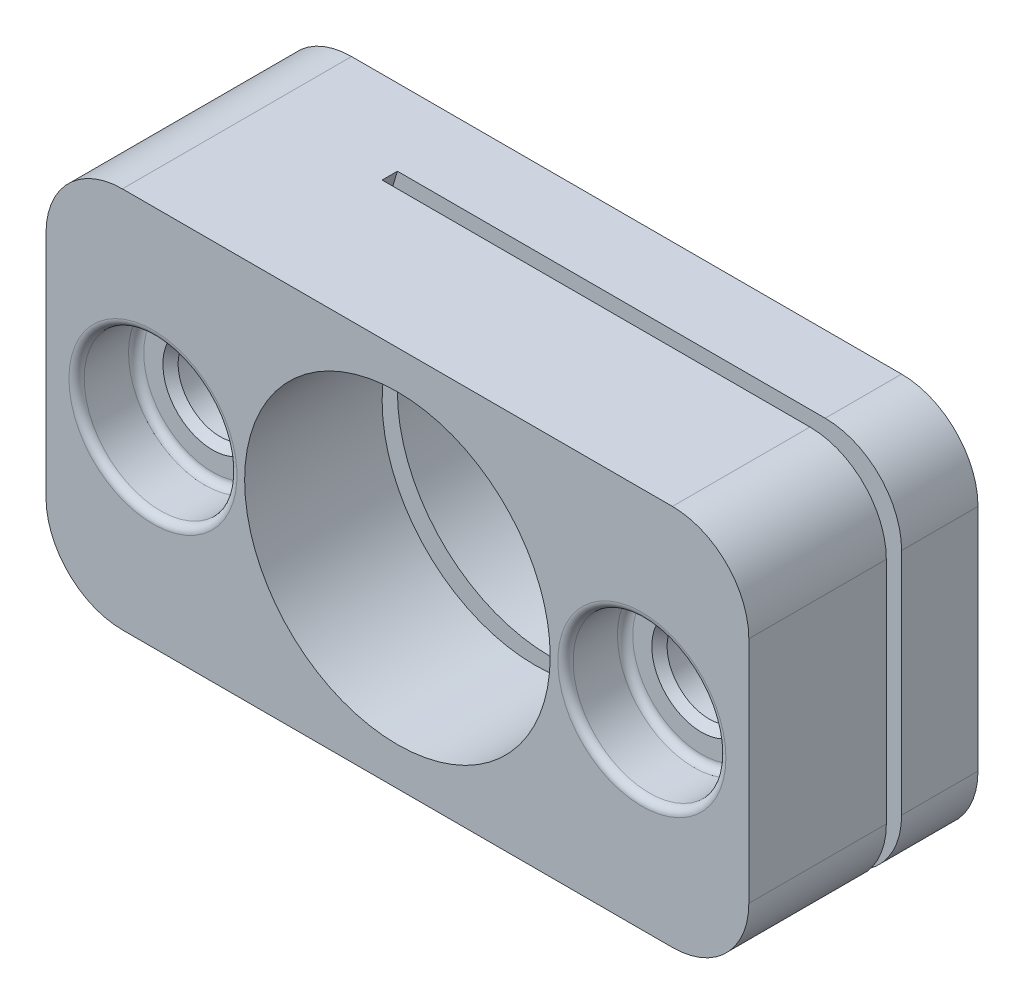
ISO-10303-21;
HEADER;
FILE_DESCRIPTION(('STEP AP214'),'2;1');
FILE_NAME('part.step','',(''),(''),'','','');
FILE_SCHEMA(('AUTOMOTIVE_DESIGN { 1 0 10303 214 1 1 1 1 }'));
ENDSEC;
DATA;
#1=APPLICATION_CONTEXT('core data for automotive mechanical design processes');
#2=APPLICATION_PROTOCOL_DEFINITION('international standard','automotive_design',2000,#1);
#3=PRODUCT_CONTEXT('',#1,'mechanical');
#4=PRODUCT('Part','Part','',(#3));
#5=PRODUCT_RELATED_PRODUCT_CATEGORY('part','',(#4));
#6=PRODUCT_DEFINITION_FORMATION('','',#4);
#7=PRODUCT_DEFINITION_CONTEXT('part definition',#1,'design');
#8=PRODUCT_DEFINITION('design','',#6,#7);
#9=PRODUCT_DEFINITION_SHAPE('','',#8);
#10=(LENGTH_UNIT() NAMED_UNIT(*) SI_UNIT(.MILLI.,.METRE.));
#11=(NAMED_UNIT(*) PLANE_ANGLE_UNIT() SI_UNIT($,.RADIAN.));
#12=(NAMED_UNIT(*) SI_UNIT($,.STERADIAN.) SOLID_ANGLE_UNIT());
#13=UNCERTAINTY_MEASURE_WITH_UNIT(LENGTH_MEASURE(1.E-05),#10,'distance_accuracy_value','');
#14=(GEOMETRIC_REPRESENTATION_CONTEXT(3) GLOBAL_UNCERTAINTY_ASSIGNED_CONTEXT((#13)) GLOBAL_UNIT_ASSIGNED_CONTEXT((#10,
#11,#12)) REPRESENTATION_CONTEXT('',''));
#15=CARTESIAN_POINT('',(0.,0.,0.));
#16=DIRECTION('',(0.,0.,1.));
#17=DIRECTION('',(1.,0.,0.));
#18=AXIS2_PLACEMENT_3D('',#15,#16,#17);
#19=CARTESIAN_POINT('',(35.25,0.,11.1));
#20=DIRECTION('',(0.,0.,1.));
#21=DIRECTION('',(1.,0.,0.));
#22=AXIS2_PLACEMENT_3D('',#19,#20,#21);
#23=PLANE('',#22);
#24=CARTESIAN_POINT('',(32.,0.,11.0999999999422));
#25=DIRECTION('',(0.,0.,1.));
#26=DIRECTION('',(1.,0.,0.));
#27=AXIS2_PLACEMENT_3D('',#24,#25,#26);
#28=CIRCLE('',#27,3.2499999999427);
#29=CARTESIAN_POINT('',(35.2499999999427,0.,11.0999999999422));
#30=VERTEX_POINT('',#29);
#31=EDGE_CURVE('E18',#30,#30,#28,.F.);
#32=ORIENTED_EDGE('',*,*,#31,.T.);
#33=EDGE_LOOP('',(#32));
#34=FACE_BOUND('',#33,.T.);
#35=CARTESIAN_POINT('',(32.,0.,11.1));
#36=DIRECTION('',(0.,0.,-1.));
#37=DIRECTION('',(1.,0.,0.));
#38=AXIS2_PLACEMENT_3D('',#35,#36,#37);
#39=CIRCLE('',#38,4.5);
#40=CARTESIAN_POINT('',(36.5,0.,11.1));
#41=VERTEX_POINT('',#40);
#42=EDGE_CURVE('E285',#41,#41,#39,.F.);
#43=ORIENTED_EDGE('',*,*,#42,.T.);
#44=EDGE_LOOP('',(#43));
#45=FACE_BOUND('',#44,.T.);
#46=ADVANCED_FACE('F14',(#34,#45),#23,.T.);
#47=CARTESIAN_POINT('',(32.,0.,11.6));
#48=DIRECTION('',(0.,0.,1.));
#49=DIRECTION('',(1.,0.,0.));
#50=AXIS2_PLACEMENT_3D('',#47,#48,#49);
#51=TOROIDAL_SURFACE('',#50,4.5,0.5);
#52=CARTESIAN_POINT('',(32.,0.,11.6));
#53=DIRECTION('',(0.,0.,-1.));
#54=DIRECTION('',(-1.,0.,0.));
#55=AXIS2_PLACEMENT_3D('',#52,#53,#54);
#56=CIRCLE('',#55,5.);
#57=CARTESIAN_POINT('',(27.,0.,11.6));
#58=VERTEX_POINT('',#57);
#59=EDGE_CURVE('E234',#58,#58,#56,.F.);
#60=ORIENTED_EDGE('',*,*,#59,.T.);
#61=EDGE_LOOP('',(#60));
#62=FACE_BOUND('',#61,.T.);
#63=ORIENTED_EDGE('',*,*,#42,.F.);
#64=EDGE_LOOP('',(#63));
#65=FACE_BOUND('',#64,.T.);
#66=ADVANCED_FACE('F267',(#62,#65),#51,.F.);
#67=CARTESIAN_POINT('',(0.,0.,11.6));
#68=DIRECTION('',(0.,0.,-1.));
#69=DIRECTION('',(-1.,0.,0.));
#70=AXIS2_PLACEMENT_3D('',#67,#68,#69);
#71=TOROIDAL_SURFACE('',#70,4.5,0.5);
#72=CARTESIAN_POINT('',(0.,0.,11.1));
#73=DIRECTION('',(0.,0.,-1.));
#74=DIRECTION('',(-1.,0.,0.));
#75=AXIS2_PLACEMENT_3D('',#72,#73,#74);
#76=CIRCLE('',#75,4.5);
#77=CARTESIAN_POINT('',(-4.5,0.,11.1));
#78=VERTEX_POINT('',#77);
#79=EDGE_CURVE('E245',#78,#78,#76,.F.);
#80=ORIENTED_EDGE('',*,*,#79,.F.);
#81=EDGE_LOOP('',(#80));
#82=FACE_BOUND('',#81,.T.);
#83=CARTESIAN_POINT('',(0.,0.,11.6));
#84=DIRECTION('',(0.,0.,1.));
#85=DIRECTION('',(1.,0.,0.));
#86=AXIS2_PLACEMENT_3D('',#83,#84,#85);
#87=CIRCLE('',#86,5.);
#88=CARTESIAN_POINT('',(5.,0.,11.6));
#89=VERTEX_POINT('',#88);
#90=EDGE_CURVE('E231',#89,#89,#87,.T.);
#91=ORIENTED_EDGE('',*,*,#90,.T.);
#92=EDGE_LOOP('',(#91));
#93=FACE_BOUND('',#92,.T.);
#94=ADVANCED_FACE('F263',(#82,#93),#71,.F.);
#95=CARTESIAN_POINT('',(-4.5,0.,11.1));
#96=DIRECTION('',(0.,0.,1.));
#97=DIRECTION('',(1.,0.,0.));
#98=AXIS2_PLACEMENT_3D('',#95,#96,#97);
#99=PLANE('',#98);
#100=ORIENTED_EDGE('',*,*,#79,.T.);
#101=EDGE_LOOP('',(#100));
#102=FACE_BOUND('',#101,.T.);
#103=CARTESIAN_POINT('',(0.,0.,11.099999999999));
#104=DIRECTION('',(0.,0.,1.));
#105=DIRECTION('',(1.,0.,0.));
#106=AXIS2_PLACEMENT_3D('',#103,#104,#105);
#107=CIRCLE('',#106,3.25000000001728);
#108=CARTESIAN_POINT('',(3.25000000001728,0.,11.099999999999));
#109=VERTEX_POINT('',#108);
#110=EDGE_CURVE('E228',#109,#109,#107,.F.);
#111=ORIENTED_EDGE('',*,*,#110,.T.);
#112=EDGE_LOOP('',(#111));
#113=FACE_BOUND('',#112,.T.);
#114=ADVANCED_FACE('F252',(#102,#113),#99,.T.);
#115=CARTESIAN_POINT('',(32.,0.,11.0999999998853));
#116=DIRECTION('',(0.,0.,1.));
#117=DIRECTION('',(1.,0.,0.));
#118=AXIS2_PLACEMENT_3D('',#115,#116,#117);
#119=CONICAL_SURFACE('',#118,3.24999999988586,0.785398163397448);
#120=CARTESIAN_POINT('',(32.,0.,10.6));
#121=DIRECTION('',(0.,0.,-1.));
#122=DIRECTION('',(-1.,0.,0.));
#123=AXIS2_PLACEMENT_3D('',#120,#121,#122);
#124=CIRCLE('',#123,2.75);
#125=CARTESIAN_POINT('',(29.25,0.,10.6));
#126=VERTEX_POINT('',#125);
#127=EDGE_CURVE('E224',#126,#126,#124,.T.);
#128=ORIENTED_EDGE('',*,*,#127,.T.);
#129=EDGE_LOOP('',(#128));
#130=FACE_BOUND('',#129,.T.);
#131=ORIENTED_EDGE('',*,*,#31,.F.);
#132=EDGE_LOOP('',(#131));
#133=FACE_BOUND('',#132,.T.);
#134=ADVANCED_FACE('F262',(#130,#133),#119,.F.);
#135=CARTESIAN_POINT('',(32.,0.,15.));
#136=DIRECTION('',(0.,0.,-1.));
#137=DIRECTION('',(-1.,0.,0.));
#138=AXIS2_PLACEMENT_3D('',#135,#136,#137);
#139=CYLINDRICAL_SURFACE('',#138,5.);
#140=ORIENTED_EDGE('',*,*,#59,.F.);
#141=EDGE_LOOP('',(#140));
#142=FACE_BOUND('',#141,.T.);
#143=CARTESIAN_POINT('',(32.,0.,14.5));
#144=DIRECTION('',(0.,0.,1.));
#145=DIRECTION('',(1.,0.,0.));
#146=AXIS2_PLACEMENT_3D('',#143,#144,#145);
#147=CIRCLE('',#146,5.);
#148=CARTESIAN_POINT('',(37.,0.,14.5));
#149=VERTEX_POINT('',#148);
#150=EDGE_CURVE('E125',#149,#149,#147,.F.);
#151=ORIENTED_EDGE('',*,*,#150,.F.);
#152=EDGE_LOOP('',(#151));
#153=FACE_BOUND('',#152,.T.);
#154=ADVANCED_FACE('F505',(#142,#153),#139,.F.);
#155=CARTESIAN_POINT('',(0.,0.,0.));
#156=DIRECTION('',(0.,0.,1.));
#157=DIRECTION('',(1.,0.,0.));
#158=AXIS2_PLACEMENT_3D('',#155,#156,#157);
#159=CYLINDRICAL_SURFACE('',#158,5.);
#160=CARTESIAN_POINT('',(0.,0.,14.5));
#161=DIRECTION('',(0.,0.,-1.));
#162=DIRECTION('',(-1.,0.,0.));
#163=AXIS2_PLACEMENT_3D('',#160,#161,#162);
#164=CIRCLE('',#163,5.);
#165=CARTESIAN_POINT('',(-5.,0.,14.5));
#166=VERTEX_POINT('',#165);
#167=EDGE_CURVE('E171',#166,#166,#164,.T.);
#168=ORIENTED_EDGE('',*,*,#167,.F.);
#169=EDGE_LOOP('',(#168));
#170=FACE_BOUND('',#169,.T.);
#171=ORIENTED_EDGE('',*,*,#90,.F.);
#172=EDGE_LOOP('',(#171));
#173=FACE_BOUND('',#172,.T.);
#174=ADVANCED_FACE('F349',(#170,#173),#159,.F.);
#175=CARTESIAN_POINT('',(0.,0.,11.099999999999));
#176=DIRECTION('',(0.,0.,1.));
#177=DIRECTION('',(1.,0.,0.));
#178=AXIS2_PLACEMENT_3D('',#175,#176,#177);
#179=CONICAL_SURFACE('',#178,3.25000000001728,0.785398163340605);
#180=ORIENTED_EDGE('',*,*,#110,.F.);
#181=EDGE_LOOP('',(#180));
#182=FACE_BOUND('',#181,.T.);
#183=CARTESIAN_POINT('',(0.,0.,10.6));
#184=DIRECTION('',(0.,0.,1.));
#185=DIRECTION('',(1.,0.,0.));
#186=AXIS2_PLACEMENT_3D('',#183,#184,#185);
#187=CIRCLE('',#186,2.75);
#188=CARTESIAN_POINT('',(2.75,0.,10.6));
#189=VERTEX_POINT('',#188);
#190=EDGE_CURVE('E167',#189,#189,#187,.F.);
#191=ORIENTED_EDGE('',*,*,#190,.T.);
#192=EDGE_LOOP('',(#191));
#193=FACE_BOUND('',#192,.T.);
#194=ADVANCED_FACE('F345',(#182,#193),#179,.F.);
#195=CARTESIAN_POINT('',(32.,0.,15.));
#196=DIRECTION('',(0.,0.,-1.));
#197=DIRECTION('',(-1.,0.,0.));
#198=AXIS2_PLACEMENT_3D('',#195,#196,#197);
#199=CYLINDRICAL_SURFACE('',#198,2.75);
#200=CARTESIAN_POINT('',(32.,0.,6.));
#201=DIRECTION('',(0.,0.,-1.));
#202=DIRECTION('',(-1.,0.,0.));
#203=AXIS2_PLACEMENT_3D('',#200,#201,#202);
#204=CIRCLE('',#203,2.75);
#205=CARTESIAN_POINT('',(29.25,0.,6.));
#206=VERTEX_POINT('',#205);
#207=EDGE_CURVE('E135',#206,#206,#204,.T.);
#208=ORIENTED_EDGE('',*,*,#207,.T.);
#209=EDGE_LOOP('',(#208));
#210=FACE_BOUND('',#209,.T.);
#211=ORIENTED_EDGE('',*,*,#127,.F.);
#212=EDGE_LOOP('',(#211));
#213=FACE_BOUND('',#212,.T.);
#214=ADVANCED_FACE('F348',(#210,#213),#199,.F.);
#215=CARTESIAN_POINT('',(43.9967103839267,0.,6.));
#216=DIRECTION('',(0.,0.,1.));
#217=DIRECTION('',(1.,0.,0.));
#218=AXIS2_PLACEMENT_3D('',#215,#216,#217);
#219=CYLINDRICAL_SURFACE('',#218,40.);
#220=DIRECTION('',(0.,0.,1.));
#221=VECTOR('',#220,1.);
#222=CARTESIAN_POINT('',(6.,12.5,6.));
#223=LINE('',#222,#221);
#224=CARTESIAN_POINT('',(6.,12.5,6.));
#225=VERTEX_POINT('',#224);
#226=CARTESIAN_POINT('',(6.,12.5,5.));
#227=VERTEX_POINT('',#226);
#228=EDGE_CURVE('E113',#225,#227,#223,.F.);
#229=ORIENTED_EDGE('',*,*,#228,.F.);
#230=CARTESIAN_POINT('',(43.9967103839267,0.,6.));
#231=DIRECTION('',(0.,0.,1.));
#232=DIRECTION('',(1.,0.,0.));
#233=AXIS2_PLACEMENT_3D('',#230,#231,#232);
#234=CIRCLE('',#233,40.);
#235=CARTESIAN_POINT('',(6.,-12.5,6.));
#236=VERTEX_POINT('',#235);
#237=EDGE_CURVE('E177',#225,#236,#234,.T.);
#238=ORIENTED_EDGE('',*,*,#237,.T.);
#239=DIRECTION('',(0.,0.,1.));
#240=VECTOR('',#239,1.);
#241=CARTESIAN_POINT('',(6.,-12.5,6.));
#242=LINE('',#241,#240);
#243=CARTESIAN_POINT('',(6.,-12.5,5.));
#244=VERTEX_POINT('',#243);
#245=EDGE_CURVE('E126',#244,#236,#242,.T.);
#246=ORIENTED_EDGE('',*,*,#245,.F.);
#247=CARTESIAN_POINT('',(43.9967103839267,0.,5.));
#248=DIRECTION('',(0.,0.,1.));
#249=DIRECTION('',(1.,0.,0.));
#250=AXIS2_PLACEMENT_3D('',#247,#248,#249);
#251=CIRCLE('',#250,40.);
#252=EDGE_CURVE('E130',#227,#244,#251,.T.);
#253=ORIENTED_EDGE('',*,*,#252,.F.);
#254=EDGE_LOOP('',(#229,#238,#246,#253));
#255=FACE_BOUND('',#254,.T.);
#256=ADVANCED_FACE('F131',(#255),#219,.F.);
#257=CARTESIAN_POINT('',(32.,0.,14.5));
#258=DIRECTION('',(0.,0.,1.));
#259=DIRECTION('',(1.,0.,0.));
#260=AXIS2_PLACEMENT_3D('',#257,#258,#259);
#261=TOROIDAL_SURFACE('',#260,5.5,0.5);
#262=ORIENTED_EDGE('',*,*,#150,.T.);
#263=EDGE_LOOP('',(#262));
#264=FACE_BOUND('',#263,.T.);
#265=CARTESIAN_POINT('',(32.,0.,15.));
#266=DIRECTION('',(0.,0.,1.));
#267=DIRECTION('',(1.,0.,0.));
#268=AXIS2_PLACEMENT_3D('',#265,#266,#267);
#269=CIRCLE('',#268,5.50000000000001);
#270=CARTESIAN_POINT('',(37.5,0.,15.));
#271=VERTEX_POINT('',#270);
#272=EDGE_CURVE('E215',#271,#271,#269,.F.);
#273=ORIENTED_EDGE('',*,*,#272,.F.);
#274=EDGE_LOOP('',(#273));
#275=FACE_BOUND('',#274,.T.);
#276=ADVANCED_FACE('F189',(#264,#275),#261,.T.);
#277=CARTESIAN_POINT('',(0.,0.,14.5));
#278=DIRECTION('',(0.,0.,-1.));
#279=DIRECTION('',(-1.,0.,0.));
#280=AXIS2_PLACEMENT_3D('',#277,#278,#279);
#281=TOROIDAL_SURFACE('',#280,5.5,0.5);
#282=CARTESIAN_POINT('',(0.,0.,15.));
#283=DIRECTION('',(0.,0.,1.));
#284=DIRECTION('',(-1.,0.,0.));
#285=AXIS2_PLACEMENT_3D('',#282,#283,#284);
#286=CIRCLE('',#285,5.5);
#287=CARTESIAN_POINT('',(-5.5,0.,15.));
#288=VERTEX_POINT('',#287);
#289=EDGE_CURVE('E331',#288,#288,#286,.F.);
#290=ORIENTED_EDGE('',*,*,#289,.F.);
#291=EDGE_LOOP('',(#290));
#292=FACE_BOUND('',#291,.T.);
#293=ORIENTED_EDGE('',*,*,#167,.T.);
#294=EDGE_LOOP('',(#293));
#295=FACE_BOUND('',#294,.T.);
#296=ADVANCED_FACE('F183',(#292,#295),#281,.T.);
#297=CARTESIAN_POINT('',(39.,-7.5,15.));
#298=DIRECTION('',(-1.,0.,0.));
#299=DIRECTION('',(0.,0.,1.));
#300=AXIS2_PLACEMENT_3D('',#297,#298,#299);
#301=PLANE('',#300);
#302=DIRECTION('',(0.,1.,0.));
#303=VECTOR('',#302,1.);
#304=CARTESIAN_POINT('',(39.,0.,6.));
#305=LINE('',#304,#303);
#306=CARTESIAN_POINT('',(39.,-7.5,6.));
#307=VERTEX_POINT('',#306);
#308=CARTESIAN_POINT('',(39.,7.5,6.));
#309=VERTEX_POINT('',#308);
#310=EDGE_CURVE('E334',#307,#309,#305,.T.);
#311=ORIENTED_EDGE('',*,*,#310,.T.);
#312=DIRECTION('',(0.,0.,1.));
#313=VECTOR('',#312,1.);
#314=CARTESIAN_POINT('',(39.,7.5,15.));
#315=LINE('',#314,#313);
#316=CARTESIAN_POINT('',(39.,7.5,15.));
#317=VERTEX_POINT('',#316);
#318=EDGE_CURVE('E174',#317,#309,#315,.F.);
#319=ORIENTED_EDGE('',*,*,#318,.F.);
#320=DIRECTION('',(0.,1.,0.));
#321=VECTOR('',#320,1.);
#322=CARTESIAN_POINT('',(39.,-7.5,15.));
#323=LINE('',#322,#321);
#324=CARTESIAN_POINT('',(39.,-7.5,15.));
#325=VERTEX_POINT('',#324);
#326=EDGE_CURVE('E327',#325,#317,#323,.T.);
#327=ORIENTED_EDGE('',*,*,#326,.F.);
#328=DIRECTION('',(0.,0.,1.));
#329=VECTOR('',#328,1.);
#330=CARTESIAN_POINT('',(39.,-7.5,15.));
#331=LINE('',#330,#329);
#332=EDGE_CURVE('E170',#307,#325,#331,.T.);
#333=ORIENTED_EDGE('',*,*,#332,.F.);
#334=EDGE_LOOP('',(#311,#319,#327,#333));
#335=FACE_BOUND('',#334,.T.);
#336=ADVANCED_FACE('F188',(#335),#301,.F.);
#337=CARTESIAN_POINT('',(32.,0.,15.));
#338=DIRECTION('',(0.,0.,-1.));
#339=DIRECTION('',(-1.,0.,0.));
#340=AXIS2_PLACEMENT_3D('',#337,#338,#339);
#341=CYLINDRICAL_SURFACE('',#340,2.75);
#342=CARTESIAN_POINT('',(32.,0.,0.499999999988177));
#343=DIRECTION('',(0.,0.,-1.));
#344=DIRECTION('',(-1.,0.,0.));
#345=AXIS2_PLACEMENT_3D('',#342,#343,#344);
#346=CIRCLE('',#345,2.75000000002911);
#347=CARTESIAN_POINT('',(29.2499999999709,0.,0.499999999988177));
#348=VERTEX_POINT('',#347);
#349=EDGE_CURVE('E326',#348,#348,#346,.T.);
#350=ORIENTED_EDGE('',*,*,#349,.T.);
#351=EDGE_LOOP('',(#350));
#352=FACE_BOUND('',#351,.T.);
#353=CARTESIAN_POINT('',(32.,0.,5.));
#354=DIRECTION('',(0.,0.,-1.));
#355=DIRECTION('',(-1.,0.,0.));
#356=AXIS2_PLACEMENT_3D('',#353,#354,#355);
#357=CIRCLE('',#356,2.75);
#358=CARTESIAN_POINT('',(29.25,0.,5.));
#359=VERTEX_POINT('',#358);
#360=EDGE_CURVE('E136',#359,#359,#357,.T.);
#361=ORIENTED_EDGE('',*,*,#360,.F.);
#362=EDGE_LOOP('',(#361));
#363=FACE_BOUND('',#362,.T.);
#364=ADVANCED_FACE('F357',(#352,#363),#341,.F.);
#365=CARTESIAN_POINT('',(0.,0.,0.));
#366=DIRECTION('',(0.,0.,1.));
#367=DIRECTION('',(1.,0.,0.));
#368=AXIS2_PLACEMENT_3D('',#365,#366,#367);
#369=CYLINDRICAL_SURFACE('',#368,2.75);
#370=ORIENTED_EDGE('',*,*,#190,.F.);
#371=EDGE_LOOP('',(#370));
#372=FACE_BOUND('',#371,.T.);
#373=CARTESIAN_POINT('',(0.,0.,0.499999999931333));
#374=DIRECTION('',(0.,0.,-1.));
#375=DIRECTION('',(-1.,0.,0.));
#376=AXIS2_PLACEMENT_3D('',#373,#374,#375);
#377=CIRCLE('',#376,2.75000000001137);
#378=CARTESIAN_POINT('',(-2.75000000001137,0.,0.499999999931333));
#379=VERTEX_POINT('',#378);
#380=EDGE_CURVE('E323',#379,#379,#377,.T.);
#381=ORIENTED_EDGE('',*,*,#380,.T.);
#382=EDGE_LOOP('',(#381));
#383=FACE_BOUND('',#382,.T.);
#384=ADVANCED_FACE('F353',(#372,#383),#369,.F.);
#385=CARTESIAN_POINT('',(34.,-7.5,15.));
#386=DIRECTION('',(0.,0.,1.));
#387=DIRECTION('',(1.,0.,0.));
#388=AXIS2_PLACEMENT_3D('',#385,#386,#387);
#389=CYLINDRICAL_SURFACE('',#388,5.);
#390=ORIENTED_EDGE('',*,*,#332,.T.);
#391=CARTESIAN_POINT('',(34.,-7.5,15.));
#392=DIRECTION('',(0.,0.,1.));
#393=DIRECTION('',(1.,0.,0.));
#394=AXIS2_PLACEMENT_3D('',#391,#392,#393);
#395=CIRCLE('',#394,5.);
#396=CARTESIAN_POINT('',(34.,-12.5,15.));
#397=VERTEX_POINT('',#396);
#398=EDGE_CURVE('E328',#397,#325,#395,.T.);
#399=ORIENTED_EDGE('',*,*,#398,.F.);
#400=DIRECTION('',(0.,0.,1.));
#401=VECTOR('',#400,1.);
#402=CARTESIAN_POINT('',(34.,-12.5,15.));
#403=LINE('',#402,#401);
#404=CARTESIAN_POINT('',(34.,-12.5,6.));
#405=VERTEX_POINT('',#404);
#406=EDGE_CURVE('E157',#397,#405,#403,.F.);
#407=ORIENTED_EDGE('',*,*,#406,.T.);
#408=CARTESIAN_POINT('',(34.,-7.5,6.));
#409=DIRECTION('',(0.,0.,1.));
#410=DIRECTION('',(1.,0.,0.));
#411=AXIS2_PLACEMENT_3D('',#408,#409,#410);
#412=CIRCLE('',#411,5.);
#413=EDGE_CURVE('E335',#405,#307,#412,.T.);
#414=ORIENTED_EDGE('',*,*,#413,.T.);
#415=EDGE_LOOP('',(#390,#399,#407,#414));
#416=FACE_BOUND('',#415,.T.);
#417=ADVANCED_FACE('F356',(#416),#389,.T.);
#418=CARTESIAN_POINT('',(43.9967103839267,0.,5.));
#419=DIRECTION('',(0.,0.,1.));
#420=DIRECTION('',(1.,0.,0.));
#421=AXIS2_PLACEMENT_3D('',#418,#419,#420);
#422=PLANE('',#421);
#423=CARTESIAN_POINT('',(16.,0.,5.));
#424=DIRECTION('',(0.,0.,1.));
#425=DIRECTION('',(1.,0.,0.));
#426=AXIS2_PLACEMENT_3D('',#423,#424,#425);
#427=CIRCLE('',#426,10.);
#428=CARTESIAN_POINT('',(26.,0.,5.));
#429=VERTEX_POINT('',#428);
#430=EDGE_CURVE('E455',#429,#429,#427,.T.);
#431=ORIENTED_EDGE('',*,*,#430,.F.);
#432=EDGE_LOOP('',(#431));
#433=FACE_BOUND('',#432,.T.);
#434=ORIENTED_EDGE('',*,*,#252,.T.);
#435=DIRECTION('',(1.,0.,0.));
#436=VECTOR('',#435,1.);
#437=CARTESIAN_POINT('',(-2.,-12.5,5.));
#438=LINE('',#437,#436);
#439=CARTESIAN_POINT('',(34.,-12.5,5.));
#440=VERTEX_POINT('',#439);
#441=EDGE_CURVE('E153',#244,#440,#438,.T.);
#442=ORIENTED_EDGE('',*,*,#441,.T.);
#443=CARTESIAN_POINT('',(34.,-7.5,5.));
#444=DIRECTION('',(0.,0.,1.));
#445=DIRECTION('',(1.,0.,0.));
#446=AXIS2_PLACEMENT_3D('',#443,#444,#445);
#447=CIRCLE('',#446,5.);
#448=CARTESIAN_POINT('',(39.,-7.5,5.));
#449=VERTEX_POINT('',#448);
#450=EDGE_CURVE('E164',#449,#440,#447,.F.);
#451=ORIENTED_EDGE('',*,*,#450,.F.);
#452=DIRECTION('',(0.,1.,0.));
#453=VECTOR('',#452,1.);
#454=CARTESIAN_POINT('',(39.,-7.5,5.));
#455=LINE('',#454,#453);
#456=CARTESIAN_POINT('',(39.,7.5,5.));
#457=VERTEX_POINT('',#456);
#458=EDGE_CURVE('E150',#449,#457,#455,.T.);
#459=ORIENTED_EDGE('',*,*,#458,.T.);
#460=CARTESIAN_POINT('',(34.,7.5,5.));
#461=DIRECTION('',(0.,0.,1.));
#462=DIRECTION('',(1.,0.,0.));
#463=AXIS2_PLACEMENT_3D('',#460,#461,#462);
#464=CIRCLE('',#463,5.);
#465=CARTESIAN_POINT('',(34.,12.5,5.));
#466=VERTEX_POINT('',#465);
#467=EDGE_CURVE('E141',#466,#457,#464,.F.);
#468=ORIENTED_EDGE('',*,*,#467,.F.);
#469=DIRECTION('',(1.,0.,0.));
#470=VECTOR('',#469,1.);
#471=CARTESIAN_POINT('',(34.,12.5,5.));
#472=LINE('',#471,#470);
#473=EDGE_CURVE('E117',#466,#227,#472,.F.);
#474=ORIENTED_EDGE('',*,*,#473,.T.);
#475=EDGE_LOOP('',(#434,#442,#451,#459,#468,#474));
#476=FACE_BOUND('',#475,.T.);
#477=ORIENTED_EDGE('',*,*,#360,.T.);
#478=EDGE_LOOP('',(#477));
#479=FACE_BOUND('',#478,.T.);
#480=ADVANCED_FACE('F138',(#433,#476,#479),#422,.T.);
#481=CARTESIAN_POINT('',(43.9967103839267,0.,6.));
#482=DIRECTION('',(0.,0.,1.));
#483=DIRECTION('',(1.,0.,0.));
#484=AXIS2_PLACEMENT_3D('',#481,#482,#483);
#485=PLANE('',#484);
#486=CARTESIAN_POINT('',(16.,0.,6.));
#487=DIRECTION('',(0.,0.,1.));
#488=DIRECTION('',(1.,0.,0.));
#489=AXIS2_PLACEMENT_3D('',#486,#487,#488);
#490=CIRCLE('',#489,10.);
#491=CARTESIAN_POINT('',(26.,0.,6.));
#492=VERTEX_POINT('',#491);
#493=EDGE_CURVE('E458',#492,#492,#490,.T.);
#494=ORIENTED_EDGE('',*,*,#493,.T.);
#495=EDGE_LOOP('',(#494));
#496=FACE_BOUND('',#495,.T.);
#497=ORIENTED_EDGE('',*,*,#237,.F.);
#498=DIRECTION('',(1.,0.,0.));
#499=VECTOR('',#498,1.);
#500=CARTESIAN_POINT('',(34.,12.5,6.));
#501=LINE('',#500,#499);
#502=CARTESIAN_POINT('',(34.,12.5,6.));
#503=VERTEX_POINT('',#502);
#504=EDGE_CURVE('E121',#225,#503,#501,.T.);
#505=ORIENTED_EDGE('',*,*,#504,.T.);
#506=CARTESIAN_POINT('',(34.,7.5,6.));
#507=DIRECTION('',(0.,0.,1.));
#508=DIRECTION('',(1.,0.,0.));
#509=AXIS2_PLACEMENT_3D('',#506,#507,#508);
#510=CIRCLE('',#509,5.);
#511=EDGE_CURVE('E176',#309,#503,#510,.T.);
#512=ORIENTED_EDGE('',*,*,#511,.F.);
#513=ORIENTED_EDGE('',*,*,#310,.F.);
#514=ORIENTED_EDGE('',*,*,#413,.F.);
#515=DIRECTION('',(1.,0.,0.));
#516=VECTOR('',#515,1.);
#517=CARTESIAN_POINT('',(-2.,-12.5,6.));
#518=LINE('',#517,#516);
#519=EDGE_CURVE('E160',#405,#236,#518,.F.);
#520=ORIENTED_EDGE('',*,*,#519,.T.);
#521=EDGE_LOOP('',(#497,#505,#512,#513,#514,#520));
#522=FACE_BOUND('',#521,.T.);
#523=ORIENTED_EDGE('',*,*,#207,.F.);
#524=EDGE_LOOP('',(#523));
#525=FACE_BOUND('',#524,.T.);
#526=ADVANCED_FACE('F418',(#496,#522,#525),#485,.F.);
#527=CARTESIAN_POINT('',(34.,7.5,15.));
#528=DIRECTION('',(0.,0.,1.));
#529=DIRECTION('',(1.,0.,0.));
#530=AXIS2_PLACEMENT_3D('',#527,#528,#529);
#531=CYLINDRICAL_SURFACE('',#530,5.);
#532=DIRECTION('',(0.,0.,-1.));
#533=VECTOR('',#532,1.);
#534=CARTESIAN_POINT('',(34.,12.5,15.));
#535=LINE('',#534,#533);
#536=CARTESIAN_POINT('',(34.,12.5,15.));
#537=VERTEX_POINT('',#536);
#538=EDGE_CURVE('E144',#503,#537,#535,.F.);
#539=ORIENTED_EDGE('',*,*,#538,.T.);
#540=CARTESIAN_POINT('',(34.,7.5,15.));
#541=DIRECTION('',(0.,0.,1.));
#542=DIRECTION('',(1.,0.,0.));
#543=AXIS2_PLACEMENT_3D('',#540,#541,#542);
#544=CIRCLE('',#543,5.);
#545=EDGE_CURVE('E324',#317,#537,#544,.T.);
#546=ORIENTED_EDGE('',*,*,#545,.F.);
#547=ORIENTED_EDGE('',*,*,#318,.T.);
#548=ORIENTED_EDGE('',*,*,#511,.T.);
#549=EDGE_LOOP('',(#539,#546,#547,#548));
#550=FACE_BOUND('',#549,.T.);
#551=ADVANCED_FACE('F394',(#550),#531,.T.);
#552=CARTESIAN_POINT('',(-2.,-7.5,15.));
#553=DIRECTION('',(0.,0.,1.));
#554=DIRECTION('',(1.,0.,0.));
#555=AXIS2_PLACEMENT_3D('',#552,#553,#554);
#556=PLANE('',#555);
#557=DIRECTION('',(1.,0.,0.));
#558=VECTOR('',#557,1.);
#559=CARTESIAN_POINT('',(34.,12.5,15.));
#560=LINE('',#559,#558);
#561=CARTESIAN_POINT('',(-2.,12.5,15.));
#562=VERTEX_POINT('',#561);
#563=EDGE_CURVE('E146',#537,#562,#560,.F.);
#564=ORIENTED_EDGE('',*,*,#563,.T.);
#565=CARTESIAN_POINT('',(-2.,7.5,15.));
#566=DIRECTION('',(0.,0.,1.));
#567=DIRECTION('',(1.,0.,0.));
#568=AXIS2_PLACEMENT_3D('',#565,#566,#567);
#569=CIRCLE('',#568,5.);
#570=CARTESIAN_POINT('',(-7.,7.5,15.));
#571=VERTEX_POINT('',#570);
#572=EDGE_CURVE('E315',#571,#562,#569,.F.);
#573=ORIENTED_EDGE('',*,*,#572,.F.);
#574=DIRECTION('',(0.,1.,0.));
#575=VECTOR('',#574,1.);
#576=CARTESIAN_POINT('',(-7.,7.5,15.));
#577=LINE('',#576,#575);
#578=CARTESIAN_POINT('',(-7.,-7.5,15.));
#579=VERTEX_POINT('',#578);
#580=EDGE_CURVE('E372',#571,#579,#577,.F.);
#581=ORIENTED_EDGE('',*,*,#580,.T.);
#582=CARTESIAN_POINT('',(-2.,-7.5,15.));
#583=DIRECTION('',(0.,0.,1.));
#584=DIRECTION('',(1.,0.,0.));
#585=AXIS2_PLACEMENT_3D('',#582,#583,#584);
#586=CIRCLE('',#585,5.);
#587=CARTESIAN_POINT('',(-2.,-12.5,15.));
#588=VERTEX_POINT('',#587);
#589=EDGE_CURVE('E156',#588,#579,#586,.F.);
#590=ORIENTED_EDGE('',*,*,#589,.F.);
#591=DIRECTION('',(1.,0.,0.));
#592=VECTOR('',#591,1.);
#593=CARTESIAN_POINT('',(-2.,-12.5,15.));
#594=LINE('',#593,#592);
#595=EDGE_CURVE('E161',#588,#397,#594,.T.);
#596=ORIENTED_EDGE('',*,*,#595,.T.);
#597=ORIENTED_EDGE('',*,*,#398,.T.);
#598=ORIENTED_EDGE('',*,*,#326,.T.);
#599=ORIENTED_EDGE('',*,*,#545,.T.);
#600=EDGE_LOOP('',(#564,#573,#581,#590,#596,#597,#598,#599));
#601=FACE_BOUND('',#600,.T.);
#602=CARTESIAN_POINT('',(16.,0.,15.));
#603=DIRECTION('',(0.,0.,1.));
#604=DIRECTION('',(1.,0.,0.));
#605=AXIS2_PLACEMENT_3D('',#602,#603,#604);
#606=CIRCLE('',#605,10.);
#607=CARTESIAN_POINT('',(26.,0.,15.));
#608=VERTEX_POINT('',#607);
#609=EDGE_CURVE('E462',#608,#608,#606,.T.);
#610=ORIENTED_EDGE('',*,*,#609,.F.);
#611=EDGE_LOOP('',(#610));
#612=FACE_BOUND('',#611,.T.);
#613=ORIENTED_EDGE('',*,*,#289,.T.);
#614=EDGE_LOOP('',(#613));
#615=FACE_BOUND('',#614,.T.);
#616=ORIENTED_EDGE('',*,*,#272,.T.);
#617=EDGE_LOOP('',(#616));
#618=FACE_BOUND('',#617,.T.);
#619=ADVANCED_FACE('F383',(#601,#612,#615,#618),#556,.T.);
#620=CARTESIAN_POINT('',(32.,0.,0.));
#621=DIRECTION('',(0.,0.,-1.));
#622=DIRECTION('',(-1.,0.,0.));
#623=AXIS2_PLACEMENT_3D('',#620,#621,#622);
#624=CONICAL_SURFACE('',#623,3.25000000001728,0.785398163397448);
#625=CARTESIAN_POINT('',(32.,0.,0.));
#626=DIRECTION('',(0.,0.,-1.));
#627=DIRECTION('',(-1.,0.,0.));
#628=AXIS2_PLACEMENT_3D('',#625,#626,#627);
#629=CIRCLE('',#628,3.25000000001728);
#630=CARTESIAN_POINT('',(28.7499999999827,0.,0.));
#631=VERTEX_POINT('',#630);
#632=EDGE_CURVE('E311',#631,#631,#629,.T.);
#633=ORIENTED_EDGE('',*,*,#632,.T.);
#634=EDGE_LOOP('',(#633));
#635=FACE_BOUND('',#634,.T.);
#636=ORIENTED_EDGE('',*,*,#349,.F.);
#637=EDGE_LOOP('',(#636));
#638=FACE_BOUND('',#637,.T.);
#639=ADVANCED_FACE('F393',(#635,#638),#624,.F.);
#640=CARTESIAN_POINT('',(0.,0.,-5.6843418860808E-11));
#641=DIRECTION('',(0.,0.,-1.));
#642=DIRECTION('',(-1.,0.,0.));
#643=AXIS2_PLACEMENT_3D('',#640,#641,#642);
#644=CONICAL_SURFACE('',#643,3.25000000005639,0.785398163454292);
#645=ORIENTED_EDGE('',*,*,#380,.F.);
#646=EDGE_LOOP('',(#645));
#647=FACE_BOUND('',#646,.T.);
#648=CARTESIAN_POINT('',(0.,0.,5.68434188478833E-11));
#649=DIRECTION('',(0.,0.,-1.));
#650=DIRECTION('',(-1.,0.,0.));
#651=AXIS2_PLACEMENT_3D('',#648,#649,#650);
#652=CIRCLE('',#651,3.2499999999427);
#653=CARTESIAN_POINT('',(-3.2499999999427,0.,5.68434188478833E-11));
#654=VERTEX_POINT('',#653);
#655=EDGE_CURVE('E308',#654,#654,#652,.T.);
#656=ORIENTED_EDGE('',*,*,#655,.T.);
#657=EDGE_LOOP('',(#656));
#658=FACE_BOUND('',#657,.T.);
#659=ADVANCED_FACE('F633',(#647,#658),#644,.F.);
#660=CARTESIAN_POINT('',(-2.,-7.5,15.));
#661=DIRECTION('',(0.,0.,1.));
#662=DIRECTION('',(1.,0.,0.));
#663=AXIS2_PLACEMENT_3D('',#660,#661,#662);
#664=CYLINDRICAL_SURFACE('',#663,5.);
#665=ORIENTED_EDGE('',*,*,#589,.T.);
#666=DIRECTION('',(0.,0.,-1.));
#667=VECTOR('',#666,1.);
#668=CARTESIAN_POINT('',(-7.,-7.5,15.));
#669=LINE('',#668,#667);
#670=CARTESIAN_POINT('',(-7.,-7.5,0.));
#671=VERTEX_POINT('',#670);
#672=EDGE_CURVE('E314',#579,#671,#669,.T.);
#673=ORIENTED_EDGE('',*,*,#672,.T.);
#674=CARTESIAN_POINT('',(-2.,-7.5,0.));
#675=DIRECTION('',(0.,0.,1.));
#676=DIRECTION('',(1.,0.,0.));
#677=AXIS2_PLACEMENT_3D('',#674,#675,#676);
#678=CIRCLE('',#677,5.);
#679=CARTESIAN_POINT('',(-2.,-12.5,0.));
#680=VERTEX_POINT('',#679);
#681=EDGE_CURVE('E305',#671,#680,#678,.T.);
#682=ORIENTED_EDGE('',*,*,#681,.T.);
#683=DIRECTION('',(0.,0.,1.));
#684=VECTOR('',#683,1.);
#685=CARTESIAN_POINT('',(-2.,-12.5,15.));
#686=LINE('',#685,#684);
#687=EDGE_CURVE('E155',#680,#588,#686,.T.);
#688=ORIENTED_EDGE('',*,*,#687,.T.);
#689=EDGE_LOOP('',(#665,#673,#682,#688));
#690=FACE_BOUND('',#689,.T.);
#691=ADVANCED_FACE('F642',(#690),#664,.T.);
#692=CARTESIAN_POINT('',(-2.,-12.5,15.));
#693=DIRECTION('',(0.,1.,0.));
#694=DIRECTION('',(0.,0.,1.));
#695=AXIS2_PLACEMENT_3D('',#692,#693,#694);
#696=PLANE('',#695);
#697=ORIENTED_EDGE('',*,*,#519,.F.);
#698=ORIENTED_EDGE('',*,*,#406,.F.);
#699=ORIENTED_EDGE('',*,*,#595,.F.);
#700=ORIENTED_EDGE('',*,*,#687,.F.);
#701=DIRECTION('',(1.,0.,0.));
#702=VECTOR('',#701,1.);
#703=CARTESIAN_POINT('',(-2.,-12.5,0.));
#704=LINE('',#703,#702);
#705=CARTESIAN_POINT('',(34.,-12.5,0.));
#706=VERTEX_POINT('',#705);
#707=EDGE_CURVE('E304',#680,#706,#704,.T.);
#708=ORIENTED_EDGE('',*,*,#707,.T.);
#709=DIRECTION('',(0.,0.,1.));
#710=VECTOR('',#709,1.);
#711=CARTESIAN_POINT('',(34.,-12.5,15.));
#712=LINE('',#711,#710);
#713=EDGE_CURVE('E321',#440,#706,#712,.F.);
#714=ORIENTED_EDGE('',*,*,#713,.F.);
#715=ORIENTED_EDGE('',*,*,#441,.F.);
#716=ORIENTED_EDGE('',*,*,#245,.T.);
#717=EDGE_LOOP('',(#697,#698,#699,#700,#708,#714,#715,#716));
#718=FACE_BOUND('',#717,.T.);
#719=ADVANCED_FACE('F431',(#718),#696,.F.);
#720=CARTESIAN_POINT('',(34.,-7.5,15.));
#721=DIRECTION('',(0.,0.,1.));
#722=DIRECTION('',(1.,0.,0.));
#723=AXIS2_PLACEMENT_3D('',#720,#721,#722);
#724=CYLINDRICAL_SURFACE('',#723,5.);
#725=CARTESIAN_POINT('',(34.,-7.5,0.));
#726=DIRECTION('',(0.,0.,1.));
#727=DIRECTION('',(1.,0.,0.));
#728=AXIS2_PLACEMENT_3D('',#725,#726,#727);
#729=CIRCLE('',#728,5.);
#730=CARTESIAN_POINT('',(39.,-7.5,0.));
#731=VERTEX_POINT('',#730);
#732=EDGE_CURVE('E301',#706,#731,#729,.T.);
#733=ORIENTED_EDGE('',*,*,#732,.T.);
#734=DIRECTION('',(0.,0.,1.));
#735=VECTOR('',#734,1.);
#736=CARTESIAN_POINT('',(39.,-7.5,15.));
#737=LINE('',#736,#735);
#738=EDGE_CURVE('E152',#731,#449,#737,.T.);
#739=ORIENTED_EDGE('',*,*,#738,.T.);
#740=ORIENTED_EDGE('',*,*,#450,.T.);
#741=ORIENTED_EDGE('',*,*,#713,.T.);
#742=EDGE_LOOP('',(#733,#739,#740,#741));
#743=FACE_BOUND('',#742,.T.);
#744=ADVANCED_FACE('F443',(#743),#724,.T.);
#745=CARTESIAN_POINT('',(39.,-7.5,15.));
#746=DIRECTION('',(-1.,0.,0.));
#747=DIRECTION('',(0.,0.,1.));
#748=AXIS2_PLACEMENT_3D('',#745,#746,#747);
#749=PLANE('',#748);
#750=ORIENTED_EDGE('',*,*,#738,.F.);
#751=DIRECTION('',(0.,1.,0.));
#752=VECTOR('',#751,1.);
#753=CARTESIAN_POINT('',(39.,-7.5,0.));
#754=LINE('',#753,#752);
#755=CARTESIAN_POINT('',(39.,7.5,0.));
#756=VERTEX_POINT('',#755);
#757=EDGE_CURVE('E300',#731,#756,#754,.T.);
#758=ORIENTED_EDGE('',*,*,#757,.T.);
#759=DIRECTION('',(0.,0.,1.));
#760=VECTOR('',#759,1.);
#761=CARTESIAN_POINT('',(39.,7.5,15.));
#762=LINE('',#761,#760);
#763=EDGE_CURVE('E319',#457,#756,#762,.F.);
#764=ORIENTED_EDGE('',*,*,#763,.F.);
#765=ORIENTED_EDGE('',*,*,#458,.F.);
#766=EDGE_LOOP('',(#750,#758,#764,#765));
#767=FACE_BOUND('',#766,.T.);
#768=ADVANCED_FACE('F440',(#767),#749,.F.);
#769=CARTESIAN_POINT('',(34.,7.5,15.));
#770=DIRECTION('',(0.,0.,1.));
#771=DIRECTION('',(1.,0.,0.));
#772=AXIS2_PLACEMENT_3D('',#769,#770,#771);
#773=CYLINDRICAL_SURFACE('',#772,5.);
#774=CARTESIAN_POINT('',(34.,7.5,0.));
#775=DIRECTION('',(0.,0.,1.));
#776=DIRECTION('',(1.,0.,0.));
#777=AXIS2_PLACEMENT_3D('',#774,#775,#776);
#778=CIRCLE('',#777,5.);
#779=CARTESIAN_POINT('',(34.,12.5,0.));
#780=VERTEX_POINT('',#779);
#781=EDGE_CURVE('E297',#756,#780,#778,.T.);
#782=ORIENTED_EDGE('',*,*,#781,.T.);
#783=DIRECTION('',(0.,0.,-1.));
#784=VECTOR('',#783,1.);
#785=CARTESIAN_POINT('',(34.,12.5,15.));
#786=LINE('',#785,#784);
#787=EDGE_CURVE('E142',#780,#466,#786,.F.);
#788=ORIENTED_EDGE('',*,*,#787,.T.);
#789=ORIENTED_EDGE('',*,*,#467,.T.);
#790=ORIENTED_EDGE('',*,*,#763,.T.);
#791=EDGE_LOOP('',(#782,#788,#789,#790));
#792=FACE_BOUND('',#791,.T.);
#793=ADVANCED_FACE('F675',(#792),#773,.T.);
#794=CARTESIAN_POINT('',(34.,12.5,15.));
#795=DIRECTION('',(0.,-1.,0.));
#796=DIRECTION('',(0.,0.,-1.));
#797=AXIS2_PLACEMENT_3D('',#794,#795,#796);
#798=PLANE('',#797);
#799=ORIENTED_EDGE('',*,*,#504,.F.);
#800=ORIENTED_EDGE('',*,*,#228,.T.);
#801=ORIENTED_EDGE('',*,*,#473,.F.);
#802=ORIENTED_EDGE('',*,*,#787,.F.);
#803=DIRECTION('',(1.,0.,0.));
#804=VECTOR('',#803,1.);
#805=CARTESIAN_POINT('',(-2.,12.5,0.));
#806=LINE('',#805,#804);
#807=CARTESIAN_POINT('',(-2.,12.5,0.));
#808=VERTEX_POINT('',#807);
#809=EDGE_CURVE('E296',#780,#808,#806,.F.);
#810=ORIENTED_EDGE('',*,*,#809,.T.);
#811=DIRECTION('',(0.,0.,1.));
#812=VECTOR('',#811,1.);
#813=CARTESIAN_POINT('',(-2.,12.5,15.));
#814=LINE('',#813,#812);
#815=EDGE_CURVE('E317',#562,#808,#814,.F.);
#816=ORIENTED_EDGE('',*,*,#815,.F.);
#817=ORIENTED_EDGE('',*,*,#563,.F.);
#818=ORIENTED_EDGE('',*,*,#538,.F.);
#819=EDGE_LOOP('',(#799,#800,#801,#802,#810,#816,#817,#818));
#820=FACE_BOUND('',#819,.T.);
#821=ADVANCED_FACE('F115',(#820),#798,.F.);
#822=CARTESIAN_POINT('',(-2.,7.5,15.));
#823=DIRECTION('',(0.,0.,1.));
#824=DIRECTION('',(1.,0.,0.));
#825=AXIS2_PLACEMENT_3D('',#822,#823,#824);
#826=CYLINDRICAL_SURFACE('',#825,5.);
#827=ORIENTED_EDGE('',*,*,#572,.T.);
#828=ORIENTED_EDGE('',*,*,#815,.T.);
#829=CARTESIAN_POINT('',(-2.,7.5,0.));
#830=DIRECTION('',(0.,0.,1.));
#831=DIRECTION('',(1.,0.,0.));
#832=AXIS2_PLACEMENT_3D('',#829,#830,#831);
#833=CIRCLE('',#832,5.);
#834=CARTESIAN_POINT('',(-7.,7.5,0.));
#835=VERTEX_POINT('',#834);
#836=EDGE_CURVE('E24',#808,#835,#833,.T.);
#837=ORIENTED_EDGE('',*,*,#836,.T.);
#838=DIRECTION('',(0.,0.,-1.));
#839=VECTOR('',#838,1.);
#840=CARTESIAN_POINT('',(-7.,7.5,15.));
#841=LINE('',#840,#839);
#842=EDGE_CURVE('E32',#835,#571,#841,.F.);
#843=ORIENTED_EDGE('',*,*,#842,.T.);
#844=EDGE_LOOP('',(#827,#828,#837,#843));
#845=FACE_BOUND('',#844,.T.);
#846=ADVANCED_FACE('F693',(#845),#826,.T.);
#847=CARTESIAN_POINT('',(-7.,7.5,15.));
#848=DIRECTION('',(1.,0.,0.));
#849=DIRECTION('',(0.,0.,-1.));
#850=AXIS2_PLACEMENT_3D('',#847,#848,#849);
#851=PLANE('',#850);
#852=ORIENTED_EDGE('',*,*,#672,.F.);
#853=ORIENTED_EDGE('',*,*,#580,.F.);
#854=ORIENTED_EDGE('',*,*,#842,.F.);
#855=DIRECTION('',(0.,1.,0.));
#856=VECTOR('',#855,1.);
#857=CARTESIAN_POINT('',(-7.,-7.5,0.));
#858=LINE('',#857,#856);
#859=EDGE_CURVE('E9',#835,#671,#858,.F.);
#860=ORIENTED_EDGE('',*,*,#859,.T.);
#861=EDGE_LOOP('',(#852,#853,#854,#860));
#862=FACE_BOUND('',#861,.T.);
#863=ADVANCED_FACE('F482',(#862),#851,.F.);
#864=CARTESIAN_POINT('',(-2.,-7.5,0.));
#865=DIRECTION('',(0.,0.,1.));
#866=DIRECTION('',(1.,0.,0.));
#867=AXIS2_PLACEMENT_3D('',#864,#865,#866);
#868=PLANE('',#867);
#869=ORIENTED_EDGE('',*,*,#836,.F.);
#870=ORIENTED_EDGE('',*,*,#809,.F.);
#871=ORIENTED_EDGE('',*,*,#781,.F.);
#872=ORIENTED_EDGE('',*,*,#757,.F.);
#873=ORIENTED_EDGE('',*,*,#732,.F.);
#874=ORIENTED_EDGE('',*,*,#707,.F.);
#875=ORIENTED_EDGE('',*,*,#681,.F.);
#876=ORIENTED_EDGE('',*,*,#859,.F.);
#877=EDGE_LOOP('',(#869,#870,#871,#872,#873,#874,#875,#876));
#878=FACE_BOUND('',#877,.T.);
#879=CARTESIAN_POINT('',(16.,0.,0.));
#880=DIRECTION('',(0.,0.,1.));
#881=DIRECTION('',(1.,0.,0.));
#882=AXIS2_PLACEMENT_3D('',#879,#880,#881);
#883=CIRCLE('',#882,10.);
#884=CARTESIAN_POINT('',(26.,0.,0.));
#885=VERTEX_POINT('',#884);
#886=EDGE_CURVE('E461',#885,#885,#883,.T.);
#887=ORIENTED_EDGE('',*,*,#886,.T.);
#888=EDGE_LOOP('',(#887));
#889=FACE_BOUND('',#888,.T.);
#890=ORIENTED_EDGE('',*,*,#655,.F.);
#891=EDGE_LOOP('',(#890));
#892=FACE_BOUND('',#891,.T.);
#893=ORIENTED_EDGE('',*,*,#632,.F.);
#894=EDGE_LOOP('',(#893));
#895=FACE_BOUND('',#894,.T.);
#896=ADVANCED_FACE('F468',(#878,#889,#892,#895),#868,.F.);
#897=CARTESIAN_POINT('',(16.,0.,0.));
#898=DIRECTION('',(0.,0.,1.));
#899=DIRECTION('',(1.,0.,0.));
#900=AXIS2_PLACEMENT_3D('',#897,#898,#899);
#901=CYLINDRICAL_SURFACE('',#900,10.);
#902=ORIENTED_EDGE('',*,*,#430,.T.);
#903=EDGE_LOOP('',(#902));
#904=FACE_BOUND('',#903,.T.);
#905=ORIENTED_EDGE('',*,*,#886,.F.);
#906=EDGE_LOOP('',(#905));
#907=FACE_BOUND('',#906,.T.);
#908=ADVANCED_FACE('F471',(#904,#907),#901,.F.);
#909=ORIENTED_EDGE('',*,*,#609,.T.);
#910=EDGE_LOOP('',(#909));
#911=FACE_BOUND('',#910,.T.);
#912=ORIENTED_EDGE('',*,*,#493,.F.);
#913=EDGE_LOOP('',(#912));
#914=FACE_BOUND('',#913,.T.);
#915=ADVANCED_FACE('F473',(#911,#914),#901,.F.);
#916=CLOSED_SHELL('',(#46,#66,#94,#114,#134,#154,#174,#194,#214,#256,#276,#296,#336,#364,#384,
#417,#480,#526,#551,#619,#639,#659,#691,#719,#744,#768,#793,#821,#846,#863,#896,#908,#915));
#917=MANIFOLD_SOLID_BREP('B1',#916);
#918=ADVANCED_BREP_SHAPE_REPRESENTATION('',(#18,#917),#14);
#919=SHAPE_DEFINITION_REPRESENTATION(#9,#918);
ENDSEC;
END-ISO-10303-21;
